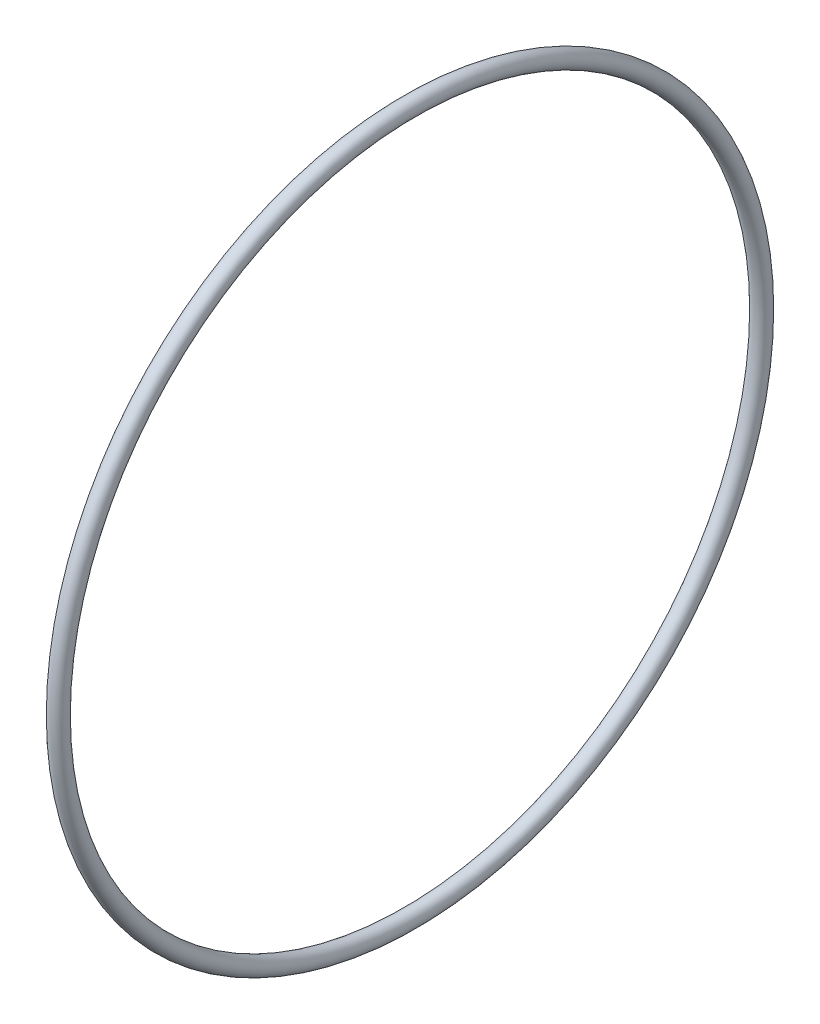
ISO-10303-21;
HEADER;
FILE_DESCRIPTION(('STEP AP214'),'2;1');
FILE_NAME('part.step','',(''),(''),'','','');
FILE_SCHEMA(('AUTOMOTIVE_DESIGN { 1 0 10303 214 1 1 1 1 }'));
ENDSEC;
DATA;
#1=APPLICATION_CONTEXT('core data for automotive mechanical design processes');
#2=APPLICATION_PROTOCOL_DEFINITION('international standard','automotive_design',2000,#1);
#3=PRODUCT_CONTEXT('',#1,'mechanical');
#4=PRODUCT('Part','Part','',(#3));
#5=PRODUCT_RELATED_PRODUCT_CATEGORY('part','',(#4));
#6=PRODUCT_DEFINITION_FORMATION('','',#4);
#7=PRODUCT_DEFINITION_CONTEXT('part definition',#1,'design');
#8=PRODUCT_DEFINITION('design','',#6,#7);
#9=PRODUCT_DEFINITION_SHAPE('','',#8);
#10=(LENGTH_UNIT() NAMED_UNIT(*) SI_UNIT(.MILLI.,.METRE.));
#11=(NAMED_UNIT(*) PLANE_ANGLE_UNIT() SI_UNIT($,.RADIAN.));
#12=(NAMED_UNIT(*) SI_UNIT($,.STERADIAN.) SOLID_ANGLE_UNIT());
#13=UNCERTAINTY_MEASURE_WITH_UNIT(LENGTH_MEASURE(1.E-05),#10,'distance_accuracy_value','');
#14=(GEOMETRIC_REPRESENTATION_CONTEXT(3) GLOBAL_UNCERTAINTY_ASSIGNED_CONTEXT((#13)) GLOBAL_UNIT_ASSIGNED_CONTEXT((#10,
#11,#12)) REPRESENTATION_CONTEXT('',''));
#15=CARTESIAN_POINT('',(0.,0.,0.));
#16=DIRECTION('',(0.,0.,1.));
#17=DIRECTION('',(1.,0.,0.));
#18=AXIS2_PLACEMENT_3D('',#15,#16,#17);
#19=CARTESIAN_POINT('',(0.,0.,0.));
#20=DIRECTION('',(-1.,0.,0.));
#21=DIRECTION('',(0.,0.,1.));
#22=AXIS2_PLACEMENT_3D('',#19,#20,#21);
#23=TOROIDAL_SURFACE('',#22,72.9996,1.7653);
#24=CARTESIAN_POINT('',(0.,0.,74.7649));
#25=VERTEX_POINT('',#24);
#26=VERTEX_LOOP('',#25);
#27=FACE_BOUND('',#26,.T.);
#28=ADVANCED_FACE('F32',(#27),#23,.T.);
#29=CLOSED_SHELL('',(#28));
#30=MANIFOLD_SOLID_BREP('B2',#29);
#31=ADVANCED_BREP_SHAPE_REPRESENTATION('',(#18,#30),#14);
#32=SHAPE_DEFINITION_REPRESENTATION(#9,#31);
ENDSEC;
END-ISO-10303-21;
